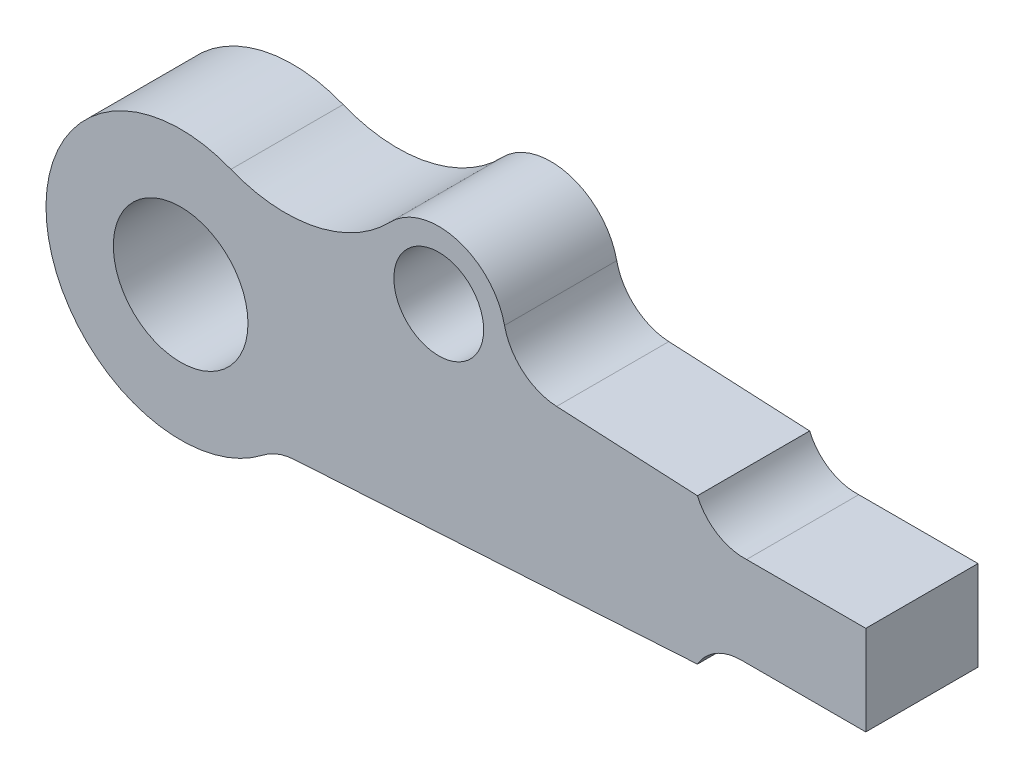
from build123d import *

# Parameters (mm, degrees)
SKETCH1_R           = 152.4
SKETCH1_R_2         = 101.6
SKETCH1_R_3         = 304.8
BOSS_EXTRUDE3_DEPTH = 254


with BuildPart() as part:
    # Sketch1 → Boss-Extrude3 (new body)
    # profile 1 of 4: a face of its own
    with BuildSketch(Plane.XY):
        with BuildLine():
            Line((257.128270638, -214.316585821), (1169.76769506, -159.18246696))
            Line((1169.76769506, -159.18246696), (1169.76769506, 171.01753304))
            Line((1169.76769506, 171.01753304), (850.934157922, 186.712291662))
            ThreePointArc((850.934157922, 186.712291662), (775.11190055, 216.635455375), (733.097223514, 286.486563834))
            ThreePointArc((733.097223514, 286.486563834), (735.721775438, 270.337428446), (736.6, 254))
            ThreePointArc((736.6, 254), (527.131397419, 112.688519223), (474.540490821, 359.832660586))
            ThreePointArc((474.540490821, 359.832660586), (305.901399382, 266.217202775), (113.733546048, 282.78564409))
            ThreePointArc((113.733546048, 282.78564409), (252.555958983, 170.641517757), (304.8, 0))
            ThreePointArc((304.8, 0), (273.745004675, -134.039965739), (186.908186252, -240.766214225))
            ThreePointArc((186.908186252, -240.766214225), (220.020213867, -222.236949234), (257.128270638, -214.316585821))
        make_face()
    # profile 2 of 4: a face of its own
    with BuildSketch(Plane.XY):
        with BuildLine():
            Line((1269.002827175, -101.6), (1550.76769506, -101.6))
            Line((1550.76769506, -101.6), (1550.76769506, 101.6))
            Line((1550.76769506, 101.6), (1280.90311053, 101.6))
            ThreePointArc((1280.90311053, 101.6), (1274.952968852, 101.445020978), (1269.002827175, 101.6))
            ThreePointArc((1269.002827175, 101.6), (1209.436035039, 122.085951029), (1169.76769506, 171.01753304))
            Line((1169.76769506, 171.01753304), (1169.76769506, -159.18246696))
            ThreePointArc((1169.76769506, -159.18246696), (1211.637001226, -117.038217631), (1269.002827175, -101.6))
        make_face()
    # profile 3 of 4: a face of its own
    with BuildSketch(Plane.XY):
        with Locations((584.2, 254)):
            Circle(SKETCH1_R)
        with Locations((584.2, 254)):
            Circle(SKETCH1_R_2, mode=Mode.SUBTRACT)
    # profile 4 of 4: a face of its own
    with BuildSketch(Plane.XY):
        Circle(SKETCH1_R_3)
        Circle(SKETCH1_R, mode=Mode.SUBTRACT)
    extrude(amount=-BOSS_EXTRUDE3_DEPTH)


solid = part.part
